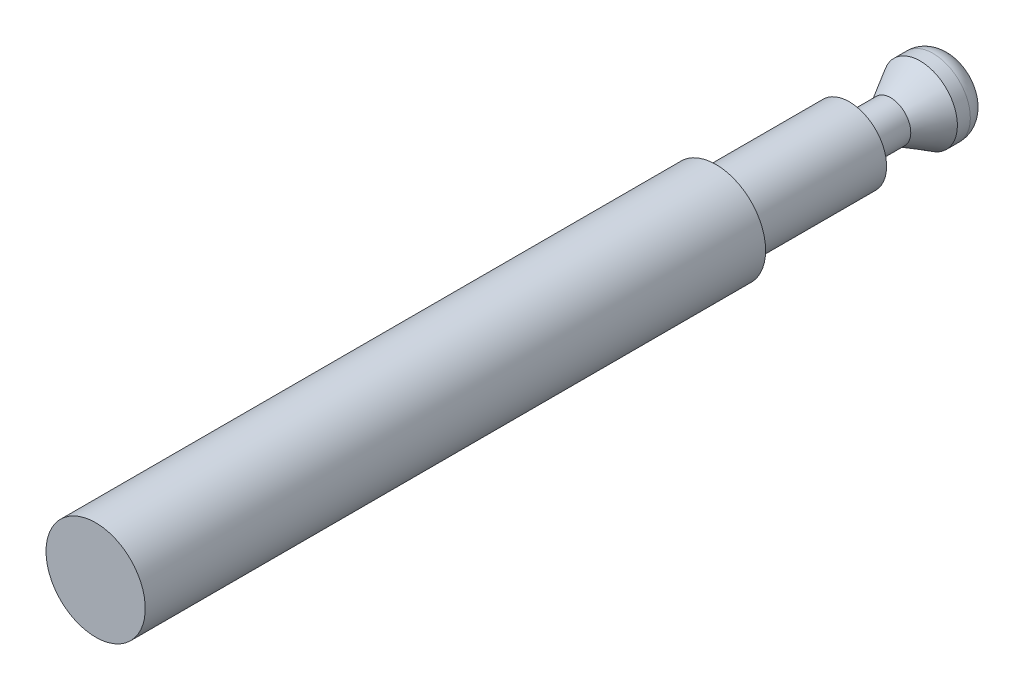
ISO-10303-21;
HEADER;
FILE_DESCRIPTION(('STEP AP214'),'2;1');
FILE_NAME('part.step','',(''),(''),'','','');
FILE_SCHEMA(('AUTOMOTIVE_DESIGN { 1 0 10303 214 1 1 1 1 }'));
ENDSEC;
DATA;
#1=APPLICATION_CONTEXT('core data for automotive mechanical design processes');
#2=APPLICATION_PROTOCOL_DEFINITION('international standard','automotive_design',2000,#1);
#3=PRODUCT_CONTEXT('',#1,'mechanical');
#4=PRODUCT('Part','Part','',(#3));
#5=PRODUCT_RELATED_PRODUCT_CATEGORY('part','',(#4));
#6=PRODUCT_DEFINITION_FORMATION('','',#4);
#7=PRODUCT_DEFINITION_CONTEXT('part definition',#1,'design');
#8=PRODUCT_DEFINITION('design','',#6,#7);
#9=PRODUCT_DEFINITION_SHAPE('','',#8);
#10=(LENGTH_UNIT() NAMED_UNIT(*) SI_UNIT(.MILLI.,.METRE.));
#11=(NAMED_UNIT(*) PLANE_ANGLE_UNIT() SI_UNIT($,.RADIAN.));
#12=(NAMED_UNIT(*) SI_UNIT($,.STERADIAN.) SOLID_ANGLE_UNIT());
#13=UNCERTAINTY_MEASURE_WITH_UNIT(LENGTH_MEASURE(1.E-05),#10,'distance_accuracy_value','');
#14=(GEOMETRIC_REPRESENTATION_CONTEXT(3) GLOBAL_UNCERTAINTY_ASSIGNED_CONTEXT((#13)) GLOBAL_UNIT_ASSIGNED_CONTEXT((#10,
#11,#12)) REPRESENTATION_CONTEXT('',''));
#15=CARTESIAN_POINT('',(0.,0.,0.));
#16=DIRECTION('',(0.,0.,1.));
#17=DIRECTION('',(1.,0.,0.));
#18=AXIS2_PLACEMENT_3D('',#15,#16,#17);
#19=CARTESIAN_POINT('',(0.,0.,-138.));
#20=DIRECTION('',(0.,0.,-1.));
#21=DIRECTION('',(0.,1.,0.));
#22=AXIS2_PLACEMENT_3D('',#19,#20,#21);
#23=PLANE('',#22);
#24=CARTESIAN_POINT('',(0.,0.,-138.));
#25=DIRECTION('',(0.,0.,-1.));
#26=DIRECTION('',(0.,1.,0.));
#27=AXIS2_PLACEMENT_3D('',#24,#25,#26);
#28=CIRCLE('',#27,3.);
#29=CARTESIAN_POINT('',(0.,3.,-138.));
#30=VERTEX_POINT('',#29);
#31=EDGE_CURVE('E18',#30,#30,#28,.T.);
#32=ORIENTED_EDGE('',*,*,#31,.T.);
#33=EDGE_LOOP('',(#32));
#34=FACE_BOUND('',#33,.T.);
#35=ADVANCED_FACE('F12',(#34),#23,.T.);
#36=CARTESIAN_POINT('',(0.,0.,-100.));
#37=DIRECTION('',(0.,0.,-1.));
#38=DIRECTION('',(0.,1.,0.));
#39=AXIS2_PLACEMENT_3D('',#36,#37,#38);
#40=CYLINDRICAL_SURFACE('',#39,6.);
#41=CARTESIAN_POINT('',(0.,0.,-135.));
#42=DIRECTION('',(0.,0.,-1.));
#43=DIRECTION('',(0.,1.,0.));
#44=AXIS2_PLACEMENT_3D('',#41,#42,#43);
#45=CIRCLE('',#44,6.);
#46=CARTESIAN_POINT('',(0.,6.,-135.));
#47=VERTEX_POINT('',#46);
#48=EDGE_CURVE('E8',#47,#47,#45,.F.);
#49=ORIENTED_EDGE('',*,*,#48,.T.);
#50=EDGE_LOOP('',(#49));
#51=FACE_BOUND('',#50,.T.);
#52=CARTESIAN_POINT('',(0.,0.,-132.913139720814));
#53=DIRECTION('',(0.,0.,-1.));
#54=DIRECTION('',(0.,1.,0.));
#55=AXIS2_PLACEMENT_3D('',#52,#53,#54);
#56=CIRCLE('',#55,6.);
#57=CARTESIAN_POINT('',(0.,6.,-132.913139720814));
#58=VERTEX_POINT('',#57);
#59=EDGE_CURVE('E31',#58,#58,#56,.T.);
#60=ORIENTED_EDGE('',*,*,#59,.T.);
#61=EDGE_LOOP('',(#60));
#62=FACE_BOUND('',#61,.T.);
#63=ADVANCED_FACE('F65',(#51,#62),#40,.T.);
#64=CARTESIAN_POINT('',(0.,0.,-132.913139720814));
#65=DIRECTION('',(0.,0.,-1.));
#66=DIRECTION('',(0.,1.,0.));
#67=AXIS2_PLACEMENT_3D('',#64,#65,#66);
#68=CONICAL_SURFACE('',#67,6.,0.5235987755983);
#69=CARTESIAN_POINT('',(0.,0.,-128.15));
#70=DIRECTION('',(0.,0.,-1.));
#71=DIRECTION('',(0.,1.,0.));
#72=AXIS2_PLACEMENT_3D('',#69,#70,#71);
#73=CIRCLE('',#72,3.25);
#74=CARTESIAN_POINT('',(0.,3.25,-128.15));
#75=VERTEX_POINT('',#74);
#76=EDGE_CURVE('E34',#75,#75,#73,.T.);
#77=ORIENTED_EDGE('',*,*,#76,.T.);
#78=EDGE_LOOP('',(#77));
#79=FACE_BOUND('',#78,.T.);
#80=ORIENTED_EDGE('',*,*,#59,.F.);
#81=EDGE_LOOP('',(#80));
#82=FACE_BOUND('',#81,.T.);
#83=ADVANCED_FACE('F70',(#79,#82),#68,.T.);
#84=CARTESIAN_POINT('',(0.,0.,-100.));
#85=DIRECTION('',(0.,0.,-1.));
#86=DIRECTION('',(0.,1.,0.));
#87=AXIS2_PLACEMENT_3D('',#84,#85,#86);
#88=CYLINDRICAL_SURFACE('',#87,3.25);
#89=CARTESIAN_POINT('',(0.,0.,-122.5));
#90=DIRECTION('',(0.,0.,-1.));
#91=DIRECTION('',(0.,1.,0.));
#92=AXIS2_PLACEMENT_3D('',#89,#90,#91);
#93=CIRCLE('',#92,3.25);
#94=CARTESIAN_POINT('',(0.,3.25,-122.5));
#95=VERTEX_POINT('',#94);
#96=EDGE_CURVE('E26',#95,#95,#93,.T.);
#97=ORIENTED_EDGE('',*,*,#96,.T.);
#98=EDGE_LOOP('',(#97));
#99=FACE_BOUND('',#98,.T.);
#100=ORIENTED_EDGE('',*,*,#76,.F.);
#101=EDGE_LOOP('',(#100));
#102=FACE_BOUND('',#101,.T.);
#103=ADVANCED_FACE('F75',(#99,#102),#88,.T.);
#104=CARTESIAN_POINT('',(3.25,0.,-121.5));
#105=DIRECTION('',(0.,0.,-1.));
#106=DIRECTION('',(0.,1.,0.));
#107=AXIS2_PLACEMENT_3D('',#104,#105,#106);
#108=PLANE('',#107);
#109=CARTESIAN_POINT('',(0.,0.,-121.5));
#110=DIRECTION('',(0.,0.,-1.));
#111=DIRECTION('',(0.,1.,0.));
#112=AXIS2_PLACEMENT_3D('',#109,#110,#111);
#113=CIRCLE('',#112,4.25);
#114=CARTESIAN_POINT('',(0.,4.25,-121.5));
#115=VERTEX_POINT('',#114);
#116=EDGE_CURVE('E22',#115,#115,#113,.F.);
#117=ORIENTED_EDGE('',*,*,#116,.T.);
#118=EDGE_LOOP('',(#117));
#119=FACE_BOUND('',#118,.T.);
#120=CARTESIAN_POINT('',(0.,0.,-121.5));
#121=DIRECTION('',(0.,0.,-1.));
#122=DIRECTION('',(0.,1.,0.));
#123=AXIS2_PLACEMENT_3D('',#120,#121,#122);
#124=CIRCLE('',#123,6.);
#125=CARTESIAN_POINT('',(0.,6.,-121.5));
#126=VERTEX_POINT('',#125);
#127=EDGE_CURVE('E37',#126,#126,#124,.T.);
#128=ORIENTED_EDGE('',*,*,#127,.T.);
#129=EDGE_LOOP('',(#128));
#130=FACE_BOUND('',#129,.T.);
#131=ADVANCED_FACE('F82',(#119,#130),#108,.T.);
#132=CARTESIAN_POINT('',(0.,0.,-100.));
#133=DIRECTION('',(0.,0.,-1.));
#134=DIRECTION('',(0.,1.,0.));
#135=AXIS2_PLACEMENT_3D('',#132,#133,#134);
#136=CYLINDRICAL_SURFACE('',#135,6.);
#137=CARTESIAN_POINT('',(0.,0.,-100.));
#138=DIRECTION('',(0.,0.,1.));
#139=DIRECTION('',(1.,0.,0.));
#140=AXIS2_PLACEMENT_3D('',#137,#138,#139);
#141=CIRCLE('',#140,6.);
#142=CARTESIAN_POINT('',(6.,0.,-100.));
#143=VERTEX_POINT('',#142);
#144=EDGE_CURVE('E40',#143,#143,#141,.F.);
#145=ORIENTED_EDGE('',*,*,#144,.T.);
#146=EDGE_LOOP('',(#145));
#147=FACE_BOUND('',#146,.T.);
#148=ORIENTED_EDGE('',*,*,#127,.F.);
#149=EDGE_LOOP('',(#148));
#150=FACE_BOUND('',#149,.T.);
#151=ADVANCED_FACE('F86',(#147,#150),#136,.T.);
#152=CARTESIAN_POINT('',(0.,0.,-122.5));
#153=DIRECTION('',(0.,0.,-1.));
#154=DIRECTION('',(0.,1.,0.));
#155=AXIS2_PLACEMENT_3D('',#152,#153,#154);
#156=TOROIDAL_SURFACE('',#155,4.25,1.);
#157=ORIENTED_EDGE('',*,*,#116,.F.);
#158=EDGE_LOOP('',(#157));
#159=FACE_BOUND('',#158,.T.);
#160=ORIENTED_EDGE('',*,*,#96,.F.);
#161=EDGE_LOOP('',(#160));
#162=FACE_BOUND('',#161,.T.);
#163=ADVANCED_FACE('F90',(#159,#162),#156,.F.);
#164=CARTESIAN_POINT('',(0.,0.,-135.));
#165=DIRECTION('',(0.,0.,-1.));
#166=DIRECTION('',(0.,1.,0.));
#167=AXIS2_PLACEMENT_3D('',#164,#165,#166);
#168=DEGENERATE_TOROIDAL_SURFACE('',#167,3.,3.,.T.);
#169=ORIENTED_EDGE('',*,*,#48,.F.);
#170=EDGE_LOOP('',(#169));
#171=FACE_BOUND('',#170,.T.);
#172=ORIENTED_EDGE('',*,*,#31,.F.);
#173=EDGE_LOOP('',(#172));
#174=FACE_BOUND('',#173,.T.);
#175=ADVANCED_FACE('F94',(#171,#174),#168,.T.);
#176=CARTESIAN_POINT('',(0.,0.,0.));
#177=DIRECTION('',(0.,0.,-1.));
#178=DIRECTION('',(-1.,0.,0.));
#179=AXIS2_PLACEMENT_3D('',#176,#177,#178);
#180=CYLINDRICAL_SURFACE('',#179,8.);
#181=CARTESIAN_POINT('',(0.,0.,0.));
#182=DIRECTION('',(0.,0.,-1.));
#183=DIRECTION('',(-1.,0.,0.));
#184=AXIS2_PLACEMENT_3D('',#181,#182,#183);
#185=CIRCLE('',#184,8.);
#186=CARTESIAN_POINT('',(-8.,0.,0.));
#187=VERTEX_POINT('',#186);
#188=EDGE_CURVE('E46',#187,#187,#185,.T.);
#189=ORIENTED_EDGE('',*,*,#188,.T.);
#190=EDGE_LOOP('',(#189));
#191=FACE_BOUND('',#190,.T.);
#192=CARTESIAN_POINT('',(0.,0.,-100.));
#193=DIRECTION('',(0.,0.,1.));
#194=DIRECTION('',(1.,0.,0.));
#195=AXIS2_PLACEMENT_3D('',#192,#193,#194);
#196=CIRCLE('',#195,8.);
#197=CARTESIAN_POINT('',(8.,0.,-100.));
#198=VERTEX_POINT('',#197);
#199=EDGE_CURVE('E43',#198,#198,#196,.T.);
#200=ORIENTED_EDGE('',*,*,#199,.T.);
#201=EDGE_LOOP('',(#200));
#202=FACE_BOUND('',#201,.T.);
#203=ADVANCED_FACE('F50',(#191,#202),#180,.T.);
#204=CARTESIAN_POINT('',(0.,0.,-100.));
#205=DIRECTION('',(0.,0.,1.));
#206=DIRECTION('',(1.,0.,0.));
#207=AXIS2_PLACEMENT_3D('',#204,#205,#206);
#208=PLANE('',#207);
#209=ORIENTED_EDGE('',*,*,#144,.F.);
#210=EDGE_LOOP('',(#209));
#211=FACE_BOUND('',#210,.T.);
#212=ORIENTED_EDGE('',*,*,#199,.F.);
#213=EDGE_LOOP('',(#212));
#214=FACE_BOUND('',#213,.T.);
#215=ADVANCED_FACE('F55',(#211,#214),#208,.F.);
#216=CARTESIAN_POINT('',(0.,0.,0.));
#217=DIRECTION('',(0.,0.,-1.));
#218=DIRECTION('',(-1.,0.,0.));
#219=AXIS2_PLACEMENT_3D('',#216,#217,#218);
#220=PLANE('',#219);
#221=ORIENTED_EDGE('',*,*,#188,.F.);
#222=EDGE_LOOP('',(#221));
#223=FACE_BOUND('',#222,.T.);
#224=ADVANCED_FACE('F53',(#223),#220,.F.);
#225=CLOSED_SHELL('',(#35,#63,#83,#103,#131,#151,#163,#175,#203,#215,#224));
#226=MANIFOLD_SOLID_BREP('B1',#225);
#227=ADVANCED_BREP_SHAPE_REPRESENTATION('',(#18,#226),#14);
#228=SHAPE_DEFINITION_REPRESENTATION(#9,#227);
ENDSEC;
END-ISO-10303-21;
